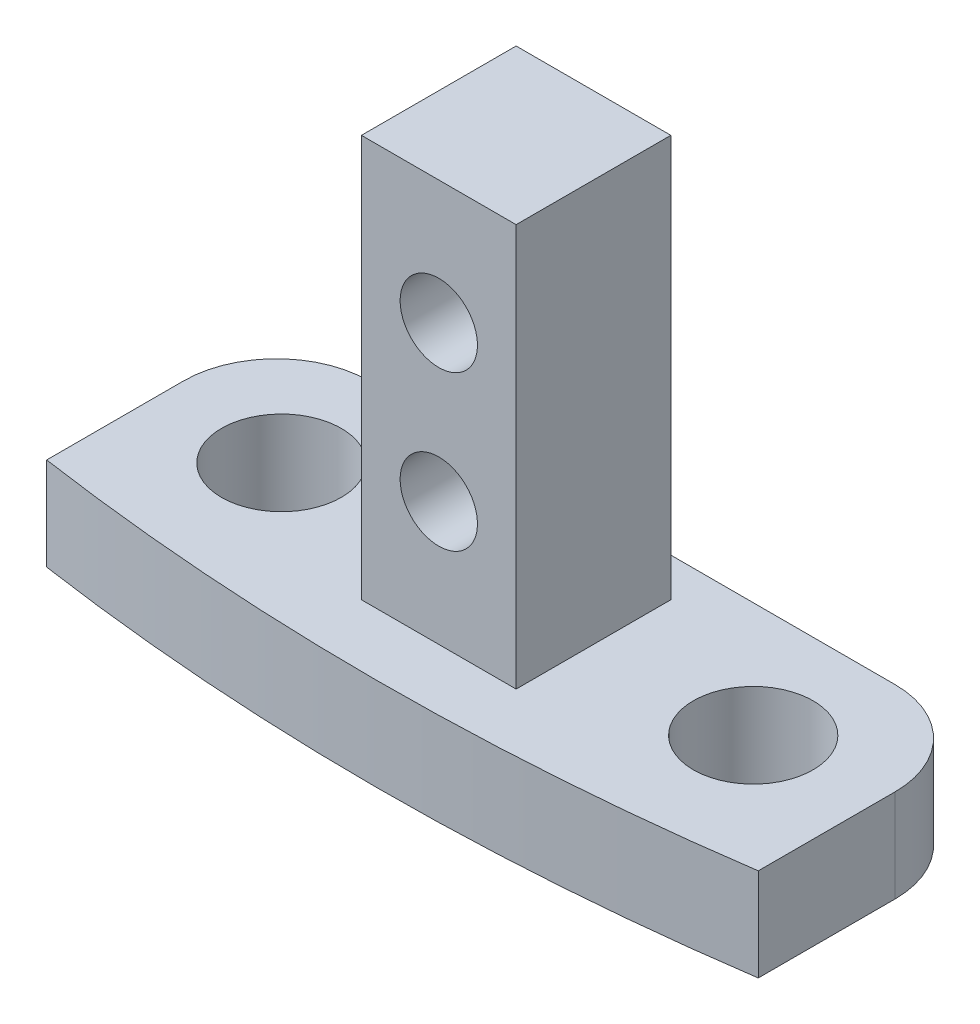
from build123d import *

# Parameters (mm, degrees)
BOSS_EXTRUDE1_DEPTH          = 3.81
SKETCH2_W                    = 6.35
SKETCH2_H                    = 6.35
BOSS_EXTRUDE2_DEPTH          = 16.51
F_10_0_1935_DIAMETER_HOLE1_D = 4.9149
F_1_8_0_125_DIAMETER_HOLE1_D = 3.175
FILLET1_R                    = 3.81


with BuildPart() as part:
    # Sketch1 → Boss-Extrude1 (new body)
    with BuildSketch(Plane(origin=(0, 0, 0), x_dir=(1, 0, 0), z_dir=(0, 1, 0))):
        with BuildLine():
            Line((-14.605, -20.781392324), (-14.605, -11.352978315))
            Line((-14.605, -11.352978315), (14.605, -11.352978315))
            Line((14.605, -11.352978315), (14.605, -20.781392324))
            ThreePointArc((14.605, -20.781392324), (0, -21.843178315), (-14.605, -20.781392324))
        make_face()
    extrude(amount=BOSS_EXTRUDE1_DEPTH)

    # Sketch2 → Boss-Extrude2 (add)
    with BuildSketch(Plane(origin=(0, 3.81, 0), x_dir=(1, 0, 0), z_dir=(0, 1, 0))):
        with Locations((0, -16.115478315)):
            Rectangle(SKETCH2_W, SKETCH2_H)
    extrude(amount=BOSS_EXTRUDE2_DEPTH)

    # 10 _0.1935_ Diameter Hole1 (through all)
    with Locations(Plane(origin=(0, 3.81, 0), x_dir=(1, 0, 0), z_dir=(0, 1, 0))):
        with Locations((9.68375, -16.06718532), (-9.68375, -16.06718532)):
            Hole(F_10_0_1935_DIAMETER_HOLE1_D / 2)

    # 1_8 _0.125_ Diameter Hole1 (through all)
    with Locations(Plane(origin=(0, 0, 12.940478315), x_dir=(-1, 0, 0), z_dir=(0, 0, -1))):
        with Locations((0, 15.24), (0, 8.89)):
            Hole(F_1_8_0_125_DIAMETER_HOLE1_D / 2)

    # Fillet1
    fillet1_edges = [part.edges().sort_by_distance(p)[0] for p in [
        (-14.605, 1.905, 11.352978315),
        (14.605, 1.905, 11.352978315),
    ]]
    fillet(fillet1_edges, radius=FILLET1_R)


solid = part.part
